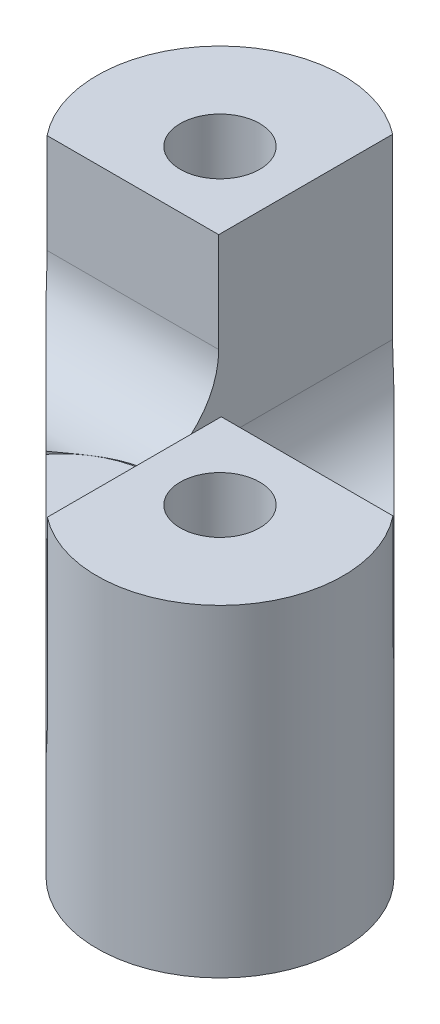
from build123d import *

# Parameters (mm, degrees)
SKETCH_1_R               = 5.260874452
SKETCH_1_R_2             = 1.7
EXTRUDE_1_DEPTH          = 13.8
CUT_EXTRUDE_1_DEPTH      = 22.76468758
CUT_EXTRUDE_1_DEPTH_BACK = 22.76468758
CUT_EXTRUDE_2_DEPTH      = 22.764687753
CUT_EXTRUDE_2_DEPTH_BACK = 22.764687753
SKETCH_3_R               = 3.344779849
SKETCH_4_R               = 4
CUT_EXTRUDE_3_DEPTH      = 7.6


with BuildPart() as part:
    # Sketch 1 → Extrude 1 (new body)
    # profile 1 of 3: a face of its own
    with BuildSketch(Plane(origin=(0, 0, 0), x_dir=(1, 0, 0), z_dir=(0, 1, 0))):
        with BuildLine():
            Line((10.36, -2.92), (-2.92, 10.36))
            ThreePointArc((-2.92, 10.36), (-1.779585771, 8.653249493), (-1.379125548, 6.64))
            ThreePointArc((-1.379125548, 6.64), (-4.626750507, 1.779585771), (-10.36, 2.92))
            Line((-10.36, 2.92), (2.92, -10.36))
            ThreePointArc((2.92, -10.36), (2.92, -2.92), (10.36, -2.92))
        make_face()
    # profile 2 of 3: a face of its own
    with BuildSketch(Plane(origin=(0, 0, 0), x_dir=(1, 0, 0), z_dir=(0, 1, 0))):
        with Locations((6.64, -6.64)):
            Circle(SKETCH_1_R)
        with Locations(Location((6.64, -6.64, 0), (0, 0, 90))):
            Circle(SKETCH_1_R_2, mode=Mode.SUBTRACT)
    # profile 3 of 3: a face of its own
    with BuildSketch(Plane(origin=(0, 0, 0), x_dir=(1, 0, 0), z_dir=(0, 1, 0))):
        with Locations((-6.64, 6.64)):
            Circle(SKETCH_1_R)
        with Locations(Location((-6.64, 6.64, 0), (0, 0, 90))):
            Circle(SKETCH_1_R_2, mode=Mode.SUBTRACT)
    extrude(amount=EXTRUDE_1_DEPTH)

    # Sketch 2 → Cut-Extrude 1 (cut, two sides: drawn at the far end of the back side and taken through both)
    with BuildSketch(Plane.XY.offset(-CUT_EXTRUDE_1_DEPTH_BACK)):
        with BuildLine():
            Line((-3.4, 6.2), (-3.4, 20.804503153))
            Line((-3.4, 20.804503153), (3.4, 20.804503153))
            Line((3.4, 20.804503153), (3.4, 6.2))
            ThreePointArc((3.4, 6.2), (0, 2.8), (-3.4, 6.2))
        make_face()
    extrude(amount=CUT_EXTRUDE_1_DEPTH + CUT_EXTRUDE_1_DEPTH_BACK, mode=Mode.SUBTRACT)

    # Sketch 3 → Cut-Extrude 2 (cut, two sides: drawn at the far end of the back side and taken through both)
    with BuildSketch(Plane(origin=(0, 0, 0), x_dir=(0, 0, -1), z_dir=(1, 0, 0)).offset(-CUT_EXTRUDE_2_DEPTH_BACK)):
        with Locations((0, 9.544779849)):
            Circle(SKETCH_3_R)
        with BuildLine():
            Line((3.344779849, 9.544779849), (3.344779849, 16.218176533))
            Line((3.344779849, 16.218176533), (0, 16.218176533))
            Line((0, 16.218176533), (-3.344779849, 16.218176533))
            Line((-3.344779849, 16.218176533), (-3.344779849, 9.544779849))
            ThreePointArc((-3.344779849, 9.544779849), (0, 12.889559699), (3.344779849, 9.544779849))
        make_face()
    extrude(amount=CUT_EXTRUDE_2_DEPTH + CUT_EXTRUDE_2_DEPTH_BACK, mode=Mode.SUBTRACT)

    # Sketch 4 → Cut-Extrude 3 (cut)
    with BuildSketch(Plane(origin=(0, 13.8, 0), x_dir=(1, 0, 0), z_dir=(0, 1, 0))):
        with Locations((3.4, 3.344779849)):
            Circle(SKETCH_4_R)
        with Locations((-3.4, -3.344779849)):
            Circle(SKETCH_4_R)
    extrude(amount=-CUT_EXTRUDE_3_DEPTH, mode=Mode.SUBTRACT)


solid = part.part
